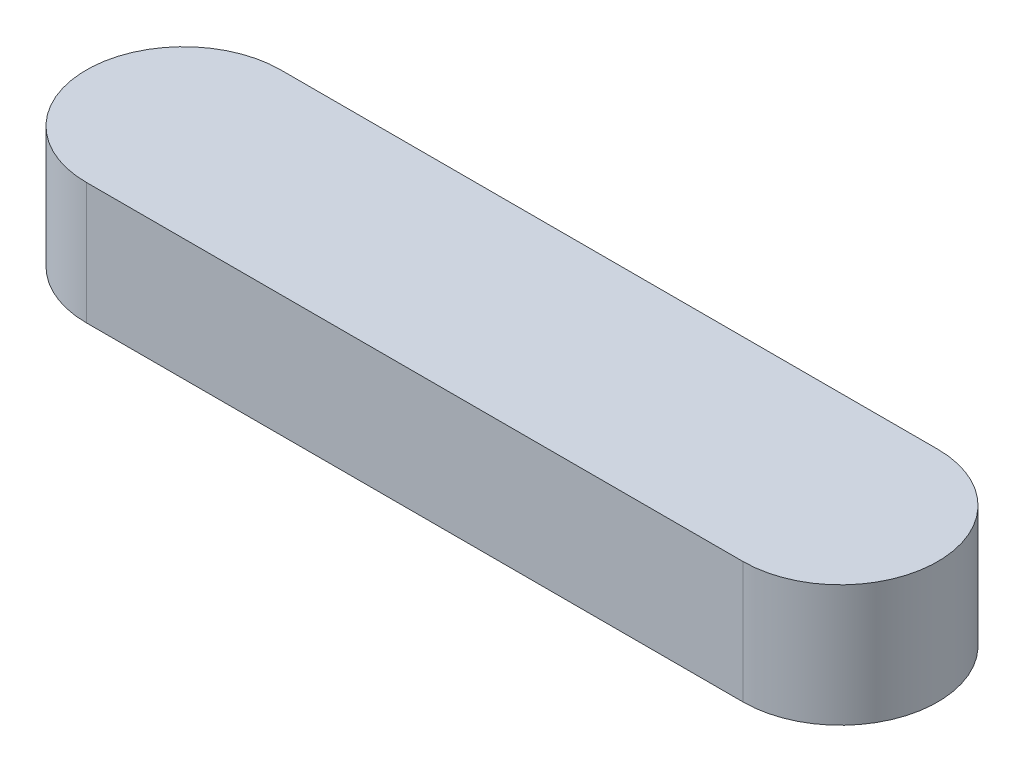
from build123d import *

# Parameters (mm, degrees)
EXTRUDE1_DEPTH = 10


with BuildPart() as part:
    # Sketch1 → Extrude1 (new body)
    with BuildSketch(Plane(origin=(0, 0, 0), x_dir=(1, 0, 0), z_dir=(0, 1, 0))):
        with BuildLine():
            Line((54, 8), (0, 8))
            ThreePointArc((0, 8), (-8, 0), (0, -8))
            Line((0, -8), (54, -8))
            ThreePointArc((54, -8), (62, 0), (54, 8))
        make_face()
    extrude(amount=EXTRUDE1_DEPTH)


solid = part.part
